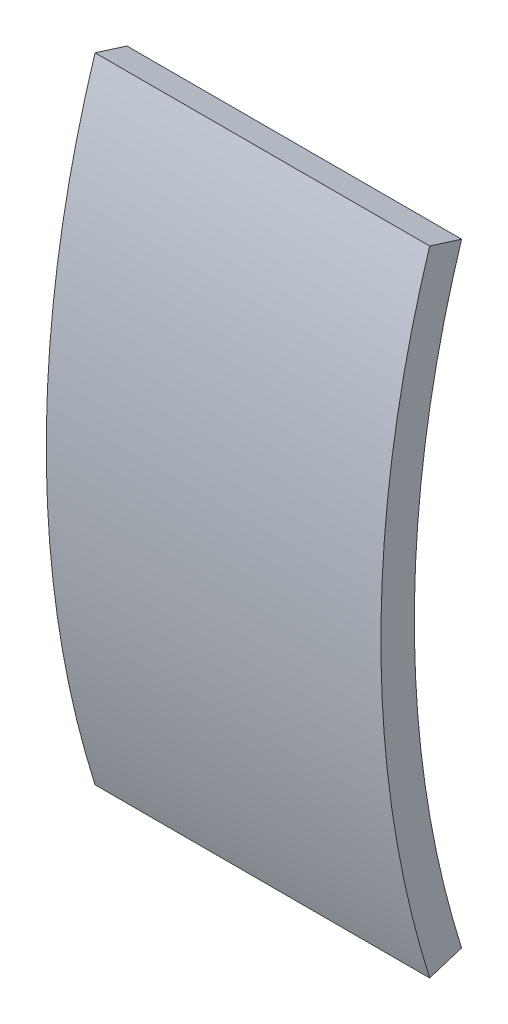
ISO-10303-21;
HEADER;
FILE_DESCRIPTION(('STEP AP214'),'2;1');
FILE_NAME('part.step','',(''),(''),'','','');
FILE_SCHEMA(('AUTOMOTIVE_DESIGN { 1 0 10303 214 1 1 1 1 }'));
ENDSEC;
DATA;
#1=APPLICATION_CONTEXT('core data for automotive mechanical design processes');
#2=APPLICATION_PROTOCOL_DEFINITION('international standard','automotive_design',2000,#1);
#3=PRODUCT_CONTEXT('',#1,'mechanical');
#4=PRODUCT('Part','Part','',(#3));
#5=PRODUCT_RELATED_PRODUCT_CATEGORY('part','',(#4));
#6=PRODUCT_DEFINITION_FORMATION('','',#4);
#7=PRODUCT_DEFINITION_CONTEXT('part definition',#1,'design');
#8=PRODUCT_DEFINITION('design','',#6,#7);
#9=PRODUCT_DEFINITION_SHAPE('','',#8);
#10=(LENGTH_UNIT() NAMED_UNIT(*) SI_UNIT(.MILLI.,.METRE.));
#11=(NAMED_UNIT(*) PLANE_ANGLE_UNIT() SI_UNIT($,.RADIAN.));
#12=(NAMED_UNIT(*) SI_UNIT($,.STERADIAN.) SOLID_ANGLE_UNIT());
#13=UNCERTAINTY_MEASURE_WITH_UNIT(LENGTH_MEASURE(1.E-05),#10,'distance_accuracy_value','');
#14=(GEOMETRIC_REPRESENTATION_CONTEXT(3) GLOBAL_UNCERTAINTY_ASSIGNED_CONTEXT((#13)) GLOBAL_UNIT_ASSIGNED_CONTEXT((#10,
#11,#12)) REPRESENTATION_CONTEXT('',''));
#15=CARTESIAN_POINT('',(0.,0.,0.));
#16=DIRECTION('',(0.,0.,1.));
#17=DIRECTION('',(1.,0.,0.));
#18=AXIS2_PLACEMENT_3D('',#15,#16,#17);
#19=CARTESIAN_POINT('',(-550.,0.,0.));
#20=DIRECTION('',(-1.,0.,0.));
#21=DIRECTION('',(0.,0.,1.));
#22=AXIS2_PLACEMENT_3D('',#19,#20,#21);
#23=CYLINDRICAL_SURFACE('',#22,315.);
#24=DIRECTION('',(-1.,0.,0.));
#25=VECTOR('',#24,1.);
#26=CARTESIAN_POINT('',(-550.,94.7223268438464,300.420839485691));
#27=LINE('',#26,#25);
#28=CARTESIAN_POINT('',(-550.,94.7223268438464,300.420839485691));
#29=VERTEX_POINT('',#28);
#30=CARTESIAN_POINT('',(-650.,94.7223268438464,300.420839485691));
#31=VERTEX_POINT('',#30);
#32=EDGE_CURVE('E46',#29,#31,#27,.T.);
#33=ORIENTED_EDGE('',*,*,#32,.T.);
#34=CARTESIAN_POINT('',(-650.,0.,0.));
#35=DIRECTION('',(1.,0.,0.));
#36=DIRECTION('',(0.,0.,-1.));
#37=AXIS2_PLACEMENT_3D('',#34,#35,#36);
#38=CIRCLE('',#37,315.);
#39=CARTESIAN_POINT('',(-650.,-94.7223268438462,300.420839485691));
#40=VERTEX_POINT('',#39);
#41=EDGE_CURVE('E86',#31,#40,#38,.T.);
#42=ORIENTED_EDGE('',*,*,#41,.T.);
#43=DIRECTION('',(-1.,0.,0.));
#44=VECTOR('',#43,1.);
#45=CARTESIAN_POINT('',(-550.,-94.7223268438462,300.420839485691));
#46=LINE('',#45,#44);
#47=CARTESIAN_POINT('',(-550.,-94.7223268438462,300.420839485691));
#48=VERTEX_POINT('',#47);
#49=EDGE_CURVE('E11',#48,#40,#46,.T.);
#50=ORIENTED_EDGE('',*,*,#49,.F.);
#51=CARTESIAN_POINT('',(-550.,0.,0.));
#52=DIRECTION('',(1.,0.,0.));
#53=DIRECTION('',(0.,0.,-1.));
#54=AXIS2_PLACEMENT_3D('',#51,#52,#53);
#55=CIRCLE('',#54,315.);
#56=EDGE_CURVE('E94',#29,#48,#55,.T.);
#57=ORIENTED_EDGE('',*,*,#56,.F.);
#58=EDGE_LOOP('',(#33,#42,#50,#57));
#59=FACE_BOUND('',#58,.T.);
#60=ADVANCED_FACE('F32',(#59),#23,.T.);
#61=CARTESIAN_POINT('',(-550.,-91.7152688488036,290.883669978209));
#62=DIRECTION('',(0.,-0.953716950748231,-0.30070579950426));
#63=DIRECTION('',(0.,0.30070579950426,-0.953716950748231));
#64=AXIS2_PLACEMENT_3D('',#61,#62,#63);
#65=PLANE('',#64);
#66=ORIENTED_EDGE('',*,*,#49,.T.);
#67=DIRECTION('',(0.,-0.30070579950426,0.953716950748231));
#68=VECTOR('',#67,1.);
#69=CARTESIAN_POINT('',(-650.,-91.7152688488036,290.883669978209));
#70=LINE('',#69,#68);
#71=CARTESIAN_POINT('',(-650.,-91.7152688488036,290.883669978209));
#72=VERTEX_POINT('',#71);
#73=EDGE_CURVE('E76',#72,#40,#70,.T.);
#74=ORIENTED_EDGE('',*,*,#73,.F.);
#75=DIRECTION('',(-1.,0.,0.));
#76=VECTOR('',#75,1.);
#77=CARTESIAN_POINT('',(-550.,-91.7152688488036,290.883669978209));
#78=LINE('',#77,#76);
#79=CARTESIAN_POINT('',(-550.,-91.7152688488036,290.883669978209));
#80=VERTEX_POINT('',#79);
#81=EDGE_CURVE('E39',#80,#72,#78,.T.);
#82=ORIENTED_EDGE('',*,*,#81,.F.);
#83=DIRECTION('',(0.,-0.30070579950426,0.953716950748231));
#84=VECTOR('',#83,1.);
#85=CARTESIAN_POINT('',(-550.,-91.7152688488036,290.883669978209));
#86=LINE('',#85,#84);
#87=EDGE_CURVE('E78',#80,#48,#86,.T.);
#88=ORIENTED_EDGE('',*,*,#87,.T.);
#89=EDGE_LOOP('',(#66,#74,#82,#88));
#90=FACE_BOUND('',#89,.T.);
#91=ADVANCED_FACE('F75',(#90),#65,.T.);
#92=CARTESIAN_POINT('',(-550.,0.,0.));
#93=DIRECTION('',(-1.,0.,0.));
#94=DIRECTION('',(0.,0.,1.));
#95=AXIS2_PLACEMENT_3D('',#92,#93,#94);
#96=CYLINDRICAL_SURFACE('',#95,305.);
#97=ORIENTED_EDGE('',*,*,#81,.T.);
#98=CARTESIAN_POINT('',(-650.,0.,0.));
#99=DIRECTION('',(1.,0.,0.));
#100=DIRECTION('',(0.,0.,-1.));
#101=AXIS2_PLACEMENT_3D('',#98,#99,#100);
#102=CIRCLE('',#101,305.);
#103=CARTESIAN_POINT('',(-650.,91.7152688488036,290.883669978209));
#104=VERTEX_POINT('',#103);
#105=EDGE_CURVE('E87',#104,#72,#102,.T.);
#106=ORIENTED_EDGE('',*,*,#105,.F.);
#107=DIRECTION('',(-1.,0.,0.));
#108=VECTOR('',#107,1.);
#109=CARTESIAN_POINT('',(-550.,91.7152688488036,290.883669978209));
#110=LINE('',#109,#108);
#111=CARTESIAN_POINT('',(-550.,91.7152688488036,290.883669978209));
#112=VERTEX_POINT('',#111);
#113=EDGE_CURVE('E54',#112,#104,#110,.T.);
#114=ORIENTED_EDGE('',*,*,#113,.F.);
#115=CARTESIAN_POINT('',(-550.,0.,0.));
#116=DIRECTION('',(1.,0.,0.));
#117=DIRECTION('',(0.,0.,-1.));
#118=AXIS2_PLACEMENT_3D('',#115,#116,#117);
#119=CIRCLE('',#118,305.);
#120=EDGE_CURVE('E97',#112,#80,#119,.T.);
#121=ORIENTED_EDGE('',*,*,#120,.T.);
#122=EDGE_LOOP('',(#97,#106,#114,#121));
#123=FACE_BOUND('',#122,.T.);
#124=ADVANCED_FACE('F102',(#123),#96,.F.);
#125=CARTESIAN_POINT('',(-550.,94.7223268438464,300.420839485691));
#126=DIRECTION('',(0.,0.953716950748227,-0.300705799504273));
#127=DIRECTION('',(0.,0.300705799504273,0.953716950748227));
#128=AXIS2_PLACEMENT_3D('',#125,#126,#127);
#129=PLANE('',#128);
#130=ORIENTED_EDGE('',*,*,#113,.T.);
#131=DIRECTION('',(0.,-0.300705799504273,-0.953716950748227));
#132=VECTOR('',#131,1.);
#133=CARTESIAN_POINT('',(-650.,94.7223268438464,300.420839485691));
#134=LINE('',#133,#132);
#135=EDGE_CURVE('E92',#31,#104,#134,.T.);
#136=ORIENTED_EDGE('',*,*,#135,.F.);
#137=ORIENTED_EDGE('',*,*,#32,.F.);
#138=DIRECTION('',(0.,-0.300705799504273,-0.953716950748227));
#139=VECTOR('',#138,1.);
#140=CARTESIAN_POINT('',(-550.,94.7223268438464,300.420839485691));
#141=LINE('',#140,#139);
#142=EDGE_CURVE('E99',#29,#112,#141,.T.);
#143=ORIENTED_EDGE('',*,*,#142,.T.);
#144=EDGE_LOOP('',(#130,#136,#137,#143));
#145=FACE_BOUND('',#144,.T.);
#146=ADVANCED_FACE('F106',(#145),#129,.T.);
#147=CARTESIAN_POINT('',(-550.,0.,0.));
#148=DIRECTION('',(1.,0.,0.));
#149=DIRECTION('',(0.,0.,-1.));
#150=AXIS2_PLACEMENT_3D('',#147,#148,#149);
#151=PLANE('',#150);
#152=ORIENTED_EDGE('',*,*,#56,.T.);
#153=ORIENTED_EDGE('',*,*,#87,.F.);
#154=ORIENTED_EDGE('',*,*,#120,.F.);
#155=ORIENTED_EDGE('',*,*,#142,.F.);
#156=EDGE_LOOP('',(#152,#153,#154,#155));
#157=FACE_BOUND('',#156,.T.);
#158=ADVANCED_FACE('F104',(#157),#151,.T.);
#159=CARTESIAN_POINT('',(-650.,0.,0.));
#160=DIRECTION('',(1.,0.,0.));
#161=DIRECTION('',(0.,0.,-1.));
#162=AXIS2_PLACEMENT_3D('',#159,#160,#161);
#163=PLANE('',#162);
#164=ORIENTED_EDGE('',*,*,#41,.F.);
#165=ORIENTED_EDGE('',*,*,#135,.T.);
#166=ORIENTED_EDGE('',*,*,#105,.T.);
#167=ORIENTED_EDGE('',*,*,#73,.T.);
#168=EDGE_LOOP('',(#164,#165,#166,#167));
#169=FACE_BOUND('',#168,.T.);
#170=ADVANCED_FACE('F84',(#169),#163,.F.);
#171=CLOSED_SHELL('',(#60,#91,#124,#146,#158,#170));
#172=MANIFOLD_SOLID_BREP('B2',#171);
#173=ADVANCED_BREP_SHAPE_REPRESENTATION('',(#18,#172),#14);
#174=SHAPE_DEFINITION_REPRESENTATION(#9,#173);
ENDSEC;
END-ISO-10303-21;
